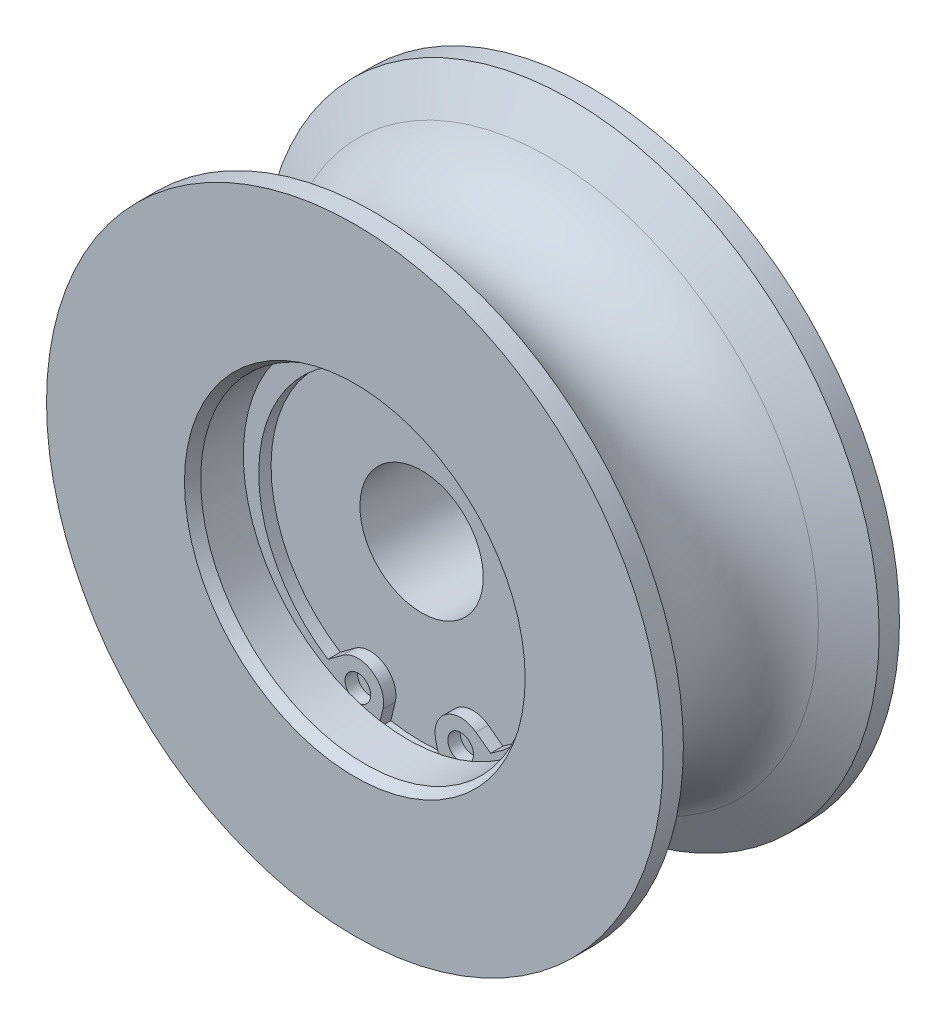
ISO-10303-21;
HEADER;
FILE_DESCRIPTION(('STEP AP214'),'2;1');
FILE_NAME('part.step','',(''),(''),'','','');
FILE_SCHEMA(('AUTOMOTIVE_DESIGN { 1 0 10303 214 1 1 1 1 }'));
ENDSEC;
DATA;
#1=APPLICATION_CONTEXT('core data for automotive mechanical design processes');
#2=APPLICATION_PROTOCOL_DEFINITION('international standard','automotive_design',2000,#1);
#3=PRODUCT_CONTEXT('',#1,'mechanical');
#4=PRODUCT('Part','Part','',(#3));
#5=PRODUCT_RELATED_PRODUCT_CATEGORY('part','',(#4));
#6=PRODUCT_DEFINITION_FORMATION('','',#4);
#7=PRODUCT_DEFINITION_CONTEXT('part definition',#1,'design');
#8=PRODUCT_DEFINITION('design','',#6,#7);
#9=PRODUCT_DEFINITION_SHAPE('','',#8);
#10=(LENGTH_UNIT() NAMED_UNIT(*) SI_UNIT(.MILLI.,.METRE.));
#11=(NAMED_UNIT(*) PLANE_ANGLE_UNIT() SI_UNIT($,.RADIAN.));
#12=(NAMED_UNIT(*) SI_UNIT($,.STERADIAN.) SOLID_ANGLE_UNIT());
#13=UNCERTAINTY_MEASURE_WITH_UNIT(LENGTH_MEASURE(1.E-05),#10,'distance_accuracy_value','');
#14=(GEOMETRIC_REPRESENTATION_CONTEXT(3) GLOBAL_UNCERTAINTY_ASSIGNED_CONTEXT((#13)) GLOBAL_UNIT_ASSIGNED_CONTEXT((#10,
#11,#12)) REPRESENTATION_CONTEXT('',''));
#15=CARTESIAN_POINT('',(0.,0.,0.));
#16=DIRECTION('',(0.,0.,1.));
#17=DIRECTION('',(1.,0.,0.));
#18=AXIS2_PLACEMENT_3D('',#15,#16,#17);
#19=CARTESIAN_POINT('',(17.0522,-17.110876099,5.));
#20=DIRECTION('',(0.,0.,-1.));
#21=DIRECTION('',(-1.,0.,0.));
#22=AXIS2_PLACEMENT_3D('',#19,#20,#21);
#23=PLANE('',#22);
#24=CARTESIAN_POINT('',(5.,-14.2233767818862,5.));
#25=DIRECTION('',(0.,0.,1.));
#26=DIRECTION('',(1.,0.,0.));
#27=AXIS2_PLACEMENT_3D('',#24,#25,#26);
#28=CIRCLE('',#27,1.25);
#29=CARTESIAN_POINT('',(6.25,-14.2233767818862,5.));
#30=VERTEX_POINT('',#29);
#31=EDGE_CURVE('E117',#30,#30,#28,.T.);
#32=ORIENTED_EDGE('',*,*,#31,.T.);
#33=EDGE_LOOP('',(#32));
#34=FACE_BOUND('',#33,.T.);
#35=ADVANCED_FACE('F14',(#34),#23,.F.);
#36=CARTESIAN_POINT('',(-5.,-14.2233767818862,5.));
#37=DIRECTION('',(0.,0.,-1.));
#38=DIRECTION('',(1.,0.,0.));
#39=AXIS2_PLACEMENT_3D('',#36,#37,#38);
#40=CIRCLE('',#39,1.25);
#41=CARTESIAN_POINT('',(-3.75,-14.2233767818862,5.));
#42=VERTEX_POINT('',#41);
#43=EDGE_CURVE('E143',#42,#42,#40,.T.);
#44=ORIENTED_EDGE('',*,*,#43,.F.);
#45=EDGE_LOOP('',(#44));
#46=FACE_BOUND('',#45,.T.);
#47=ADVANCED_FACE('F268',(#46),#23,.F.);
#48=CARTESIAN_POINT('',(0.,0.,0.));
#49=DIRECTION('',(0.,0.,1.));
#50=DIRECTION('',(1.,0.,0.));
#51=AXIS2_PLACEMENT_3D('',#48,#49,#50);
#52=TOROIDAL_SURFACE('',#51,30.4999999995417,8.4999999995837);
#53=CARTESIAN_POINT('',(0.,0.,-7.361215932));
#54=DIRECTION('',(0.,0.,-1.));
#55=DIRECTION('',(-1.,0.,0.));
#56=AXIS2_PLACEMENT_3D('',#53,#54,#55);
#57=CIRCLE('',#56,26.25);
#58=CARTESIAN_POINT('',(-26.25,0.,-7.361215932));
#59=VERTEX_POINT('',#58);
#60=EDGE_CURVE('E184',#59,#59,#57,.T.);
#61=ORIENTED_EDGE('',*,*,#60,.F.);
#62=EDGE_LOOP('',(#61));
#63=FACE_BOUND('',#62,.T.);
#64=CARTESIAN_POINT('',(0.,0.,7.361215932));
#65=DIRECTION('',(0.,0.,1.));
#66=DIRECTION('',(1.,0.,0.));
#67=AXIS2_PLACEMENT_3D('',#64,#65,#66);
#68=CIRCLE('',#67,26.25);
#69=CARTESIAN_POINT('',(26.25,0.,7.361215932));
#70=VERTEX_POINT('',#69);
#71=EDGE_CURVE('E144',#70,#70,#68,.T.);
#72=ORIENTED_EDGE('',*,*,#71,.F.);
#73=EDGE_LOOP('',(#72));
#74=FACE_BOUND('',#73,.T.);
#75=ADVANCED_FACE('F16',(#63,#74),#52,.F.);
#76=CARTESIAN_POINT('',(0.,0.,7.361215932));
#77=DIRECTION('',(0.,0.,1.));
#78=DIRECTION('',(1.,0.,0.));
#79=AXIS2_PLACEMENT_3D('',#76,#77,#78);
#80=CONICAL_SURFACE('',#79,26.25,1.04719755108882);
#81=CARTESIAN_POINT('',(0.,0.,9.52627944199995));
#82=DIRECTION('',(0.,0.,1.));
#83=DIRECTION('',(1.,0.,0.));
#84=AXIS2_PLACEMENT_3D('',#81,#82,#83);
#85=CIRCLE('',#84,30.);
#86=CARTESIAN_POINT('',(30.,0.,9.52627944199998));
#87=VERTEX_POINT('',#86);
#88=EDGE_CURVE('E182',#87,#87,#85,.F.);
#89=ORIENTED_EDGE('',*,*,#88,.T.);
#90=EDGE_LOOP('',(#89));
#91=FACE_BOUND('',#90,.T.);
#92=ORIENTED_EDGE('',*,*,#71,.T.);
#93=EDGE_LOOP('',(#92));
#94=FACE_BOUND('',#93,.T.);
#95=ADVANCED_FACE('F279',(#91,#94),#80,.T.);
#96=CARTESIAN_POINT('',(0.,0.,-7.361215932));
#97=DIRECTION('',(0.,0.,-1.));
#98=DIRECTION('',(-1.,0.,0.));
#99=AXIS2_PLACEMENT_3D('',#96,#97,#98);
#100=CONICAL_SURFACE('',#99,26.25,1.04719755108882);
#101=CARTESIAN_POINT('',(0.,0.,-9.52627944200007));
#102=DIRECTION('',(0.,0.,-1.));
#103=DIRECTION('',(-1.,0.,0.));
#104=AXIS2_PLACEMENT_3D('',#101,#102,#103);
#105=CIRCLE('',#104,30.);
#106=CARTESIAN_POINT('',(-30.,0.,-9.52627944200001));
#107=VERTEX_POINT('',#106);
#108=EDGE_CURVE('E179',#107,#107,#105,.F.);
#109=ORIENTED_EDGE('',*,*,#108,.T.);
#110=EDGE_LOOP('',(#109));
#111=FACE_BOUND('',#110,.T.);
#112=ORIENTED_EDGE('',*,*,#60,.T.);
#113=EDGE_LOOP('',(#112));
#114=FACE_BOUND('',#113,.T.);
#115=ADVANCED_FACE('F310',(#111,#114),#100,.T.);
#116=CARTESIAN_POINT('',(0.,0.,9.526279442));
#117=DIRECTION('',(0.,0.,1.));
#118=DIRECTION('',(1.,0.,0.));
#119=AXIS2_PLACEMENT_3D('',#116,#117,#118);
#120=CYLINDRICAL_SURFACE('',#119,30.);
#121=CARTESIAN_POINT('',(0.,0.,11.5));
#122=DIRECTION('',(0.,0.,1.));
#123=DIRECTION('',(1.,0.,0.));
#124=AXIS2_PLACEMENT_3D('',#121,#122,#123);
#125=CIRCLE('',#124,30.);
#126=CARTESIAN_POINT('',(30.,0.,11.5));
#127=VERTEX_POINT('',#126);
#128=EDGE_CURVE('E183',#127,#127,#125,.F.);
#129=ORIENTED_EDGE('',*,*,#128,.T.);
#130=EDGE_LOOP('',(#129));
#131=FACE_BOUND('',#130,.T.);
#132=ORIENTED_EDGE('',*,*,#88,.F.);
#133=EDGE_LOOP('',(#132));
#134=FACE_BOUND('',#133,.T.);
#135=ADVANCED_FACE('F301',(#131,#134),#120,.T.);
#136=CARTESIAN_POINT('',(0.,0.,-11.5));
#137=DIRECTION('',(0.,0.,1.));
#138=DIRECTION('',(1.,0.,0.));
#139=AXIS2_PLACEMENT_3D('',#136,#137,#138);
#140=CYLINDRICAL_SURFACE('',#139,30.);
#141=ORIENTED_EDGE('',*,*,#108,.F.);
#142=EDGE_LOOP('',(#141));
#143=FACE_BOUND('',#142,.T.);
#144=CARTESIAN_POINT('',(0.,0.,-11.5));
#145=DIRECTION('',(0.,0.,1.));
#146=DIRECTION('',(1.,0.,0.));
#147=AXIS2_PLACEMENT_3D('',#144,#145,#146);
#148=CIRCLE('',#147,30.);
#149=CARTESIAN_POINT('',(30.,0.,-11.5));
#150=VERTEX_POINT('',#149);
#151=EDGE_CURVE('E198',#150,#150,#148,.T.);
#152=ORIENTED_EDGE('',*,*,#151,.T.);
#153=EDGE_LOOP('',(#152));
#154=FACE_BOUND('',#153,.T.);
#155=ADVANCED_FACE('F296',(#143,#154),#140,.T.);
#156=CARTESIAN_POINT('',(30.36,-30.464467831,11.5));
#157=DIRECTION('',(0.,0.,-1.));
#158=DIRECTION('',(-1.,0.,0.));
#159=AXIS2_PLACEMENT_3D('',#156,#157,#158);
#160=PLANE('',#159);
#161=CARTESIAN_POINT('',(0.,0.,11.5));
#162=DIRECTION('',(0.,0.,1.));
#163=DIRECTION('',(1.,0.,0.));
#164=AXIS2_PLACEMENT_3D('',#161,#162,#163);
#165=CIRCLE('',#164,16.577350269);
#166=CARTESIAN_POINT('',(16.577350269,0.,11.5));
#167=VERTEX_POINT('',#166);
#168=EDGE_CURVE('E201',#167,#167,#165,.T.);
#169=ORIENTED_EDGE('',*,*,#168,.F.);
#170=EDGE_LOOP('',(#169));
#171=FACE_BOUND('',#170,.T.);
#172=ORIENTED_EDGE('',*,*,#128,.F.);
#173=EDGE_LOOP('',(#172));
#174=FACE_BOUND('',#173,.T.);
#175=ADVANCED_FACE('F293',(#171,#174),#160,.F.);
#176=CARTESIAN_POINT('',(-30.36,-30.464467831,-11.5));
#177=DIRECTION('',(0.,0.,1.));
#178=DIRECTION('',(1.,0.,0.));
#179=AXIS2_PLACEMENT_3D('',#176,#177,#178);
#180=PLANE('',#179);
#181=CARTESIAN_POINT('',(0.,0.,-11.5));
#182=DIRECTION('',(0.,0.,1.));
#183=DIRECTION('',(1.,0.,0.));
#184=AXIS2_PLACEMENT_3D('',#181,#182,#183);
#185=CIRCLE('',#184,13.);
#186=CARTESIAN_POINT('',(13.,0.,-11.5));
#187=VERTEX_POINT('',#186);
#188=EDGE_CURVE('E194',#187,#187,#185,.F.);
#189=ORIENTED_EDGE('',*,*,#188,.F.);
#190=EDGE_LOOP('',(#189));
#191=FACE_BOUND('',#190,.T.);
#192=ORIENTED_EDGE('',*,*,#151,.F.);
#193=EDGE_LOOP('',(#192));
#194=FACE_BOUND('',#193,.T.);
#195=ADVANCED_FACE('F290',(#191,#194),#180,.F.);
#196=CARTESIAN_POINT('',(0.,0.,10.5));
#197=DIRECTION('',(0.,0.,1.));
#198=DIRECTION('',(1.,0.,0.));
#199=AXIS2_PLACEMENT_3D('',#196,#197,#198);
#200=CONICAL_SURFACE('',#199,16.,0.523598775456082);
#201=CARTESIAN_POINT('',(0.,0.,10.5));
#202=DIRECTION('',(0.,0.,1.));
#203=DIRECTION('',(1.,0.,0.));
#204=AXIS2_PLACEMENT_3D('',#201,#202,#203);
#205=CIRCLE('',#204,16.);
#206=CARTESIAN_POINT('',(16.,0.,10.5));
#207=VERTEX_POINT('',#206);
#208=EDGE_CURVE('E191',#207,#207,#205,.T.);
#209=ORIENTED_EDGE('',*,*,#208,.F.);
#210=EDGE_LOOP('',(#209));
#211=FACE_BOUND('',#210,.T.);
#212=ORIENTED_EDGE('',*,*,#168,.T.);
#213=EDGE_LOOP('',(#212));
#214=FACE_BOUND('',#213,.T.);
#215=ADVANCED_FACE('F292',(#211,#214),#200,.F.);
#216=CARTESIAN_POINT('',(0.,0.,-11.5));
#217=DIRECTION('',(0.,0.,1.));
#218=DIRECTION('',(1.,0.,0.));
#219=AXIS2_PLACEMENT_3D('',#216,#217,#218);
#220=CYLINDRICAL_SURFACE('',#219,13.);
#221=ORIENTED_EDGE('',*,*,#188,.T.);
#222=EDGE_LOOP('',(#221));
#223=FACE_BOUND('',#222,.T.);
#224=CARTESIAN_POINT('',(0.,0.,-5.));
#225=DIRECTION('',(0.,0.,1.));
#226=DIRECTION('',(1.,0.,0.));
#227=AXIS2_PLACEMENT_3D('',#224,#225,#226);
#228=CIRCLE('',#227,13.);
#229=CARTESIAN_POINT('',(13.,0.,-5.));
#230=VERTEX_POINT('',#229);
#231=EDGE_CURVE('E195',#230,#230,#228,.F.);
#232=ORIENTED_EDGE('',*,*,#231,.F.);
#233=EDGE_LOOP('',(#232));
#234=FACE_BOUND('',#233,.T.);
#235=ADVANCED_FACE('F331',(#223,#234),#220,.F.);
#236=CARTESIAN_POINT('',(0.,0.,6.35));
#237=DIRECTION('',(0.,0.,1.));
#238=DIRECTION('',(1.,0.,0.));
#239=AXIS2_PLACEMENT_3D('',#236,#237,#238);
#240=CYLINDRICAL_SURFACE('',#239,16.);
#241=CARTESIAN_POINT('',(0.,0.,6.35));
#242=DIRECTION('',(0.,0.,1.));
#243=DIRECTION('',(1.,0.,0.));
#244=AXIS2_PLACEMENT_3D('',#241,#242,#243);
#245=CIRCLE('',#244,16.);
#246=CARTESIAN_POINT('',(16.,0.,6.35));
#247=VERTEX_POINT('',#246);
#248=EDGE_CURVE('E208',#247,#247,#245,.T.);
#249=ORIENTED_EDGE('',*,*,#248,.F.);
#250=EDGE_LOOP('',(#249));
#251=FACE_BOUND('',#250,.T.);
#252=ORIENTED_EDGE('',*,*,#208,.T.);
#253=EDGE_LOOP('',(#252));
#254=FACE_BOUND('',#253,.T.);
#255=ADVANCED_FACE('F288',(#251,#254),#240,.F.);
#256=CARTESIAN_POINT('',(-13.156,-13.201269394,-5.));
#257=DIRECTION('',(0.,0.,1.));
#258=DIRECTION('',(1.,0.,0.));
#259=AXIS2_PLACEMENT_3D('',#256,#257,#258);
#260=PLANE('',#259);
#261=CARTESIAN_POINT('',(0.,0.,-5.));
#262=DIRECTION('',(0.,0.,1.));
#263=DIRECTION('',(0.,-1.,0.));
#264=AXIS2_PLACEMENT_3D('',#261,#262,#263);
#265=CIRCLE('',#264,6.);
#266=CARTESIAN_POINT('',(0.,-6.,-5.));
#267=VERTEX_POINT('',#266);
#268=EDGE_CURVE('E211',#267,#267,#265,.F.);
#269=ORIENTED_EDGE('',*,*,#268,.F.);
#270=EDGE_LOOP('',(#269));
#271=FACE_BOUND('',#270,.T.);
#272=ORIENTED_EDGE('',*,*,#231,.T.);
#273=EDGE_LOOP('',(#272));
#274=FACE_BOUND('',#273,.T.);
#275=ADVANCED_FACE('F284',(#271,#274),#260,.F.);
#276=CARTESIAN_POINT('',(-17.0522,-17.110876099,6.35));
#277=DIRECTION('',(0.,0.,1.));
#278=DIRECTION('',(1.,0.,0.));
#279=AXIS2_PLACEMENT_3D('',#276,#277,#278);
#280=PLANE('',#279);
#281=ORIENTED_EDGE('',*,*,#248,.T.);
#282=EDGE_LOOP('',(#281));
#283=FACE_BOUND('',#282,.T.);
#284=CARTESIAN_POINT('',(0.,0.,6.35));
#285=DIRECTION('',(0.,0.,1.));
#286=DIRECTION('',(1.,0.,0.));
#287=AXIS2_PLACEMENT_3D('',#284,#285,#286);
#288=CIRCLE('',#287,16.85);
#289=CARTESIAN_POINT('',(16.85,0.,6.35));
#290=VERTEX_POINT('',#289);
#291=EDGE_CURVE('E214',#290,#290,#288,.T.);
#292=ORIENTED_EDGE('',*,*,#291,.F.);
#293=EDGE_LOOP('',(#292));
#294=FACE_BOUND('',#293,.T.);
#295=ADVANCED_FACE('F281',(#283,#294),#280,.F.);
#296=CARTESIAN_POINT('',(0.,0.,5.));
#297=DIRECTION('',(0.,0.,1.));
#298=DIRECTION('',(1.,0.,0.));
#299=AXIS2_PLACEMENT_3D('',#296,#297,#298);
#300=CYLINDRICAL_SURFACE('',#299,16.85);
#301=ORIENTED_EDGE('',*,*,#291,.T.);
#302=EDGE_LOOP('',(#301));
#303=FACE_BOUND('',#302,.T.);
#304=DIRECTION('',(0.,0.,1.));
#305=VECTOR('',#304,1.);
#306=CARTESIAN_POINT('',(2.99125499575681,-16.5823669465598,5.));
#307=LINE('',#306,#305);
#308=CARTESIAN_POINT('',(2.99125499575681,-16.5823669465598,5.));
#309=VERTEX_POINT('',#308);
#310=CARTESIAN_POINT('',(2.99125499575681,-16.5823669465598,6.2));
#311=VERTEX_POINT('',#310);
#312=EDGE_CURVE('E18',#309,#311,#307,.T.);
#313=ORIENTED_EDGE('',*,*,#312,.F.);
#314=CARTESIAN_POINT('',(0.,0.,5.));
#315=DIRECTION('',(0.,0.,1.));
#316=DIRECTION('',(1.,0.,0.));
#317=AXIS2_PLACEMENT_3D('',#314,#315,#316);
#318=CIRCLE('',#317,16.85);
#319=CARTESIAN_POINT('',(-2.99125499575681,-16.5823669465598,5.));
#320=VERTEX_POINT('',#319);
#321=EDGE_CURVE('E220',#320,#309,#318,.T.);
#322=ORIENTED_EDGE('',*,*,#321,.F.);
#323=DIRECTION('',(0.,0.,1.));
#324=VECTOR('',#323,1.);
#325=CARTESIAN_POINT('',(-2.99125499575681,-16.5823669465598,5.));
#326=LINE('',#325,#324);
#327=CARTESIAN_POINT('',(-2.99125499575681,-16.5823669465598,6.2));
#328=VERTEX_POINT('',#327);
#329=EDGE_CURVE('E176',#328,#320,#326,.F.);
#330=ORIENTED_EDGE('',*,*,#329,.F.);
#331=CARTESIAN_POINT('',(0.,0.,6.2));
#332=DIRECTION('',(0.,0.,-1.));
#333=DIRECTION('',(-1.,0.,0.));
#334=AXIS2_PLACEMENT_3D('',#331,#332,#333);
#335=CIRCLE('',#334,16.85);
#336=EDGE_CURVE('E9',#311,#328,#335,.F.);
#337=ORIENTED_EDGE('',*,*,#336,.F.);
#338=EDGE_LOOP('',(#313,#322,#330,#337));
#339=FACE_BOUND('',#338,.T.);
#340=ADVANCED_FACE('F226',(#303,#339),#300,.F.);
#341=CARTESIAN_POINT('',(0.,0.,-5.));
#342=DIRECTION('',(0.,0.,1.));
#343=DIRECTION('',(0.,-1.,0.));
#344=AXIS2_PLACEMENT_3D('',#341,#342,#343);
#345=CYLINDRICAL_SURFACE('',#344,6.);
#346=ORIENTED_EDGE('',*,*,#268,.T.);
#347=EDGE_LOOP('',(#346));
#348=FACE_BOUND('',#347,.T.);
#349=CARTESIAN_POINT('',(0.,0.,5.));
#350=DIRECTION('',(0.,0.,1.));
#351=DIRECTION('',(0.,-1.,0.));
#352=AXIS2_PLACEMENT_3D('',#349,#350,#351);
#353=CIRCLE('',#352,6.);
#354=CARTESIAN_POINT('',(0.,-6.,5.));
#355=VERTEX_POINT('',#354);
#356=EDGE_CURVE('E217',#355,#355,#353,.F.);
#357=ORIENTED_EDGE('',*,*,#356,.F.);
#358=EDGE_LOOP('',(#357));
#359=FACE_BOUND('',#358,.T.);
#360=ADVANCED_FACE('F265',(#348,#359),#345,.F.);
#361=ORIENTED_EDGE('',*,*,#356,.T.);
#362=EDGE_LOOP('',(#361));
#363=FACE_BOUND('',#362,.T.);
#364=ORIENTED_EDGE('',*,*,#321,.T.);
#365=DIRECTION('',(0.231349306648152,-0.972870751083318,0.));
#366=VECTOR('',#365,1.);
#367=CARTESIAN_POINT('',(2.5678231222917,-14.8017500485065,5.));
#368=LINE('',#367,#366);
#369=CARTESIAN_POINT('',(2.5678231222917,-14.8017500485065,5.));
#370=VERTEX_POINT('',#369);
#371=EDGE_CURVE('E34',#370,#309,#368,.T.);
#372=ORIENTED_EDGE('',*,*,#371,.F.);
#373=CARTESIAN_POINT('',(5.,-14.2233767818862,5.));
#374=DIRECTION('',(0.,0.,1.));
#375=DIRECTION('',(1.,0.,0.));
#376=AXIS2_PLACEMENT_3D('',#373,#374,#375);
#377=CIRCLE('',#376,2.5);
#378=CARTESIAN_POINT('',(6.49138441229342,-12.2169439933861,5.));
#379=VERTEX_POINT('',#378);
#380=EDGE_CURVE('E134',#379,#370,#377,.T.);
#381=ORIENTED_EDGE('',*,*,#380,.F.);
#382=DIRECTION('',(-0.802573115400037,0.596553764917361,0.));
#383=VECTOR('',#382,1.);
#384=CARTESIAN_POINT('',(6.49138441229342,-12.2169439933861,5.));
#385=LINE('',#384,#383);
#386=CARTESIAN_POINT('',(7.91695293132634,-13.2765711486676,5.));
#387=VERTEX_POINT('',#386);
#388=EDGE_CURVE('E148',#387,#379,#385,.T.);
#389=ORIENTED_EDGE('',*,*,#388,.F.);
#390=CARTESIAN_POINT('',(0.,-0.95,5.));
#391=DIRECTION('',(0.,0.,-1.));
#392=DIRECTION('',(0.,-1.,0.));
#393=AXIS2_PLACEMENT_3D('',#390,#391,#392);
#394=CIRCLE('',#393,14.65);
#395=CARTESIAN_POINT('',(-7.91695293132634,-13.2765711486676,5.));
#396=VERTEX_POINT('',#395);
#397=EDGE_CURVE('E163',#396,#387,#394,.T.);
#398=ORIENTED_EDGE('',*,*,#397,.F.);
#399=DIRECTION('',(-0.802573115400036,-0.596553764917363,0.));
#400=VECTOR('',#399,1.);
#401=CARTESIAN_POINT('',(-6.49138441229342,-12.2169439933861,5.));
#402=LINE('',#401,#400);
#403=CARTESIAN_POINT('',(-6.49138441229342,-12.2169439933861,5.));
#404=VERTEX_POINT('',#403);
#405=EDGE_CURVE('E116',#404,#396,#402,.T.);
#406=ORIENTED_EDGE('',*,*,#405,.F.);
#407=CARTESIAN_POINT('',(-5.,-14.2233767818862,5.));
#408=DIRECTION('',(0.,0.,1.));
#409=DIRECTION('',(-1.,0.,0.));
#410=AXIS2_PLACEMENT_3D('',#407,#408,#409);
#411=CIRCLE('',#410,2.5);
#412=CARTESIAN_POINT('',(-2.56782312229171,-14.8017500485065,5.));
#413=VERTEX_POINT('',#412);
#414=EDGE_CURVE('E113',#413,#404,#411,.T.);
#415=ORIENTED_EDGE('',*,*,#414,.F.);
#416=DIRECTION('',(0.231349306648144,0.97287075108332,0.));
#417=VECTOR('',#416,1.);
#418=CARTESIAN_POINT('',(-2.56782312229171,-14.8017500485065,5.));
#419=LINE('',#418,#417);
#420=EDGE_CURVE('E155',#320,#413,#419,.T.);
#421=ORIENTED_EDGE('',*,*,#420,.F.);
#422=EDGE_LOOP('',(#364,#372,#381,#389,#398,#406,#415,#421));
#423=FACE_BOUND('',#422,.T.);
#424=ADVANCED_FACE('F224',(#363,#423),#23,.F.);
#425=CARTESIAN_POINT('',(0.,-0.95,6.2));
#426=DIRECTION('',(0.,0.,1.));
#427=DIRECTION('',(-1.,0.,0.));
#428=AXIS2_PLACEMENT_3D('',#425,#426,#427);
#429=CYLINDRICAL_SURFACE('',#428,14.65);
#430=ORIENTED_EDGE('',*,*,#397,.T.);
#431=DIRECTION('',(0.,0.,-1.));
#432=VECTOR('',#431,1.);
#433=CARTESIAN_POINT('',(7.91695293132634,-13.2765711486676,6.2));
#434=LINE('',#433,#432);
#435=CARTESIAN_POINT('',(7.91695293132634,-13.2765711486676,6.2));
#436=VERTEX_POINT('',#435);
#437=EDGE_CURVE('E103',#436,#387,#434,.T.);
#438=ORIENTED_EDGE('',*,*,#437,.F.);
#439=CARTESIAN_POINT('',(0.,-0.95,6.2));
#440=DIRECTION('',(0.,0.,-1.));
#441=DIRECTION('',(0.,-1.,0.));
#442=AXIS2_PLACEMENT_3D('',#439,#440,#441);
#443=CIRCLE('',#442,14.65);
#444=CARTESIAN_POINT('',(-7.91695293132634,-13.2765711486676,6.2));
#445=VERTEX_POINT('',#444);
#446=EDGE_CURVE('E104',#445,#436,#443,.T.);
#447=ORIENTED_EDGE('',*,*,#446,.F.);
#448=DIRECTION('',(0.,0.,-1.));
#449=VECTOR('',#448,1.);
#450=CARTESIAN_POINT('',(-7.91695293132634,-13.2765711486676,6.2));
#451=LINE('',#450,#449);
#452=EDGE_CURVE('E98',#445,#396,#451,.T.);
#453=ORIENTED_EDGE('',*,*,#452,.T.);
#454=EDGE_LOOP('',(#430,#438,#447,#453));
#455=FACE_BOUND('',#454,.T.);
#456=ADVANCED_FACE('F256',(#455),#429,.F.);
#457=CARTESIAN_POINT('',(6.49138441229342,-12.2169439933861,6.2));
#458=DIRECTION('',(-0.596553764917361,-0.802573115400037,0.));
#459=DIRECTION('',(-0.802573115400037,0.596553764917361,0.));
#460=AXIS2_PLACEMENT_3D('',#457,#458,#459);
#461=PLANE('',#460);
#462=ORIENTED_EDGE('',*,*,#388,.T.);
#463=DIRECTION('',(0.,0.,-1.));
#464=VECTOR('',#463,1.);
#465=CARTESIAN_POINT('',(6.49138441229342,-12.2169439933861,6.2));
#466=LINE('',#465,#464);
#467=CARTESIAN_POINT('',(6.49138441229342,-12.2169439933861,6.2));
#468=VERTEX_POINT('',#467);
#469=EDGE_CURVE('E153',#468,#379,#466,.T.);
#470=ORIENTED_EDGE('',*,*,#469,.F.);
#471=DIRECTION('',(-0.802573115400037,0.596553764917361,0.));
#472=VECTOR('',#471,1.);
#473=CARTESIAN_POINT('',(6.49138441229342,-12.2169439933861,6.2));
#474=LINE('',#473,#472);
#475=EDGE_CURVE('E138',#436,#468,#474,.T.);
#476=ORIENTED_EDGE('',*,*,#475,.F.);
#477=ORIENTED_EDGE('',*,*,#437,.T.);
#478=EDGE_LOOP('',(#462,#470,#476,#477));
#479=FACE_BOUND('',#478,.T.);
#480=ADVANCED_FACE('F251',(#479),#461,.F.);
#481=CARTESIAN_POINT('',(5.,-14.2233767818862,6.2));
#482=DIRECTION('',(0.,0.,1.));
#483=DIRECTION('',(-1.,0.,0.));
#484=AXIS2_PLACEMENT_3D('',#481,#482,#483);
#485=CYLINDRICAL_SURFACE('',#484,2.5);
#486=ORIENTED_EDGE('',*,*,#380,.T.);
#487=DIRECTION('',(0.,0.,-1.));
#488=VECTOR('',#487,1.);
#489=CARTESIAN_POINT('',(2.5678231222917,-14.8017500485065,6.2));
#490=LINE('',#489,#488);
#491=CARTESIAN_POINT('',(2.5678231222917,-14.8017500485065,6.2));
#492=VERTEX_POINT('',#491);
#493=EDGE_CURVE('E154',#492,#370,#490,.T.);
#494=ORIENTED_EDGE('',*,*,#493,.F.);
#495=CARTESIAN_POINT('',(5.,-14.2233767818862,6.2));
#496=DIRECTION('',(0.,0.,1.));
#497=DIRECTION('',(1.,0.,0.));
#498=AXIS2_PLACEMENT_3D('',#495,#496,#497);
#499=CIRCLE('',#498,2.5);
#500=EDGE_CURVE('E167',#468,#492,#499,.T.);
#501=ORIENTED_EDGE('',*,*,#500,.F.);
#502=ORIENTED_EDGE('',*,*,#469,.T.);
#503=EDGE_LOOP('',(#486,#494,#501,#502));
#504=FACE_BOUND('',#503,.T.);
#505=ADVANCED_FACE('F234',(#504),#485,.T.);
#506=CARTESIAN_POINT('',(-2.56782312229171,-14.8017500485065,6.2));
#507=DIRECTION('',(-0.97287075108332,0.231349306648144,0.));
#508=DIRECTION('',(0.,0.,1.));
#509=AXIS2_PLACEMENT_3D('',#506,#507,#508);
#510=PLANE('',#509);
#511=DIRECTION('',(0.231349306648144,0.97287075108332,0.));
#512=VECTOR('',#511,1.);
#513=CARTESIAN_POINT('',(-2.56782312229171,-14.8017500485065,6.2));
#514=LINE('',#513,#512);
#515=CARTESIAN_POINT('',(-2.56782312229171,-14.8017500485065,6.2));
#516=VERTEX_POINT('',#515);
#517=EDGE_CURVE('E122',#328,#516,#514,.T.);
#518=ORIENTED_EDGE('',*,*,#517,.F.);
#519=ORIENTED_EDGE('',*,*,#329,.T.);
#520=ORIENTED_EDGE('',*,*,#420,.T.);
#521=DIRECTION('',(0.,0.,-1.));
#522=VECTOR('',#521,1.);
#523=CARTESIAN_POINT('',(-2.56782312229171,-14.8017500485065,6.2));
#524=LINE('',#523,#522);
#525=EDGE_CURVE('E172',#516,#413,#524,.T.);
#526=ORIENTED_EDGE('',*,*,#525,.F.);
#527=EDGE_LOOP('',(#518,#519,#520,#526));
#528=FACE_BOUND('',#527,.T.);
#529=ADVANCED_FACE('F345',(#528),#510,.F.);
#530=CARTESIAN_POINT('',(0.,-0.95,6.2));
#531=DIRECTION('',(0.,0.,-1.));
#532=DIRECTION('',(0.,-1.,0.));
#533=AXIS2_PLACEMENT_3D('',#530,#531,#532);
#534=PLANE('',#533);
#535=CARTESIAN_POINT('',(-5.,-14.2233767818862,6.2));
#536=DIRECTION('',(0.,0.,-1.));
#537=DIRECTION('',(1.,0.,0.));
#538=AXIS2_PLACEMENT_3D('',#535,#536,#537);
#539=CIRCLE('',#538,1.25);
#540=CARTESIAN_POINT('',(-3.75,-14.2233767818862,6.2));
#541=VERTEX_POINT('',#540);
#542=EDGE_CURVE('E124',#541,#541,#539,.T.);
#543=ORIENTED_EDGE('',*,*,#542,.T.);
#544=EDGE_LOOP('',(#543));
#545=FACE_BOUND('',#544,.T.);
#546=CARTESIAN_POINT('',(5.,-14.2233767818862,6.2));
#547=DIRECTION('',(0.,0.,1.));
#548=DIRECTION('',(1.,0.,0.));
#549=AXIS2_PLACEMENT_3D('',#546,#547,#548);
#550=CIRCLE('',#549,1.25);
#551=CARTESIAN_POINT('',(6.25,-14.2233767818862,6.2));
#552=VERTEX_POINT('',#551);
#553=EDGE_CURVE('E140',#552,#552,#550,.T.);
#554=ORIENTED_EDGE('',*,*,#553,.F.);
#555=EDGE_LOOP('',(#554));
#556=FACE_BOUND('',#555,.T.);
#557=DIRECTION('',(0.231349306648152,-0.972870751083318,0.));
#558=VECTOR('',#557,1.);
#559=CARTESIAN_POINT('',(2.5678231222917,-14.8017500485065,6.2));
#560=LINE('',#559,#558);
#561=EDGE_CURVE('E130',#492,#311,#560,.T.);
#562=ORIENTED_EDGE('',*,*,#561,.T.);
#563=ORIENTED_EDGE('',*,*,#336,.T.);
#564=ORIENTED_EDGE('',*,*,#517,.T.);
#565=CARTESIAN_POINT('',(-5.,-14.2233767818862,6.2));
#566=DIRECTION('',(0.,0.,1.));
#567=DIRECTION('',(-1.,0.,0.));
#568=AXIS2_PLACEMENT_3D('',#565,#566,#567);
#569=CIRCLE('',#568,2.5);
#570=CARTESIAN_POINT('',(-6.49138441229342,-12.2169439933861,6.2));
#571=VERTEX_POINT('',#570);
#572=EDGE_CURVE('E110',#516,#571,#569,.T.);
#573=ORIENTED_EDGE('',*,*,#572,.T.);
#574=DIRECTION('',(-0.802573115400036,-0.596553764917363,0.));
#575=VECTOR('',#574,1.);
#576=CARTESIAN_POINT('',(-6.49138441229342,-12.2169439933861,6.2));
#577=LINE('',#576,#575);
#578=EDGE_CURVE('E93',#571,#445,#577,.T.);
#579=ORIENTED_EDGE('',*,*,#578,.T.);
#580=ORIENTED_EDGE('',*,*,#446,.T.);
#581=ORIENTED_EDGE('',*,*,#475,.T.);
#582=ORIENTED_EDGE('',*,*,#500,.T.);
#583=EDGE_LOOP('',(#562,#563,#564,#573,#579,#580,#581,#582));
#584=FACE_BOUND('',#583,.T.);
#585=ADVANCED_FACE('F120',(#545,#556,#584),#534,.F.);
#586=CARTESIAN_POINT('',(5.,-14.2233767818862,6.2));
#587=DIRECTION('',(0.,0.,1.));
#588=DIRECTION('',(-1.,0.,0.));
#589=AXIS2_PLACEMENT_3D('',#586,#587,#588);
#590=CYLINDRICAL_SURFACE('',#589,1.25);
#591=ORIENTED_EDGE('',*,*,#31,.F.);
#592=EDGE_LOOP('',(#591));
#593=FACE_BOUND('',#592,.T.);
#594=ORIENTED_EDGE('',*,*,#553,.T.);
#595=EDGE_LOOP('',(#594));
#596=FACE_BOUND('',#595,.T.);
#597=ADVANCED_FACE('F354',(#593,#596),#590,.F.);
#598=CARTESIAN_POINT('',(-5.,-14.2233767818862,6.2));
#599=DIRECTION('',(0.,0.,1.));
#600=DIRECTION('',(-1.,0.,0.));
#601=AXIS2_PLACEMENT_3D('',#598,#599,#600);
#602=CYLINDRICAL_SURFACE('',#601,1.25);
#603=ORIENTED_EDGE('',*,*,#43,.T.);
#604=EDGE_LOOP('',(#603));
#605=FACE_BOUND('',#604,.T.);
#606=ORIENTED_EDGE('',*,*,#542,.F.);
#607=EDGE_LOOP('',(#606));
#608=FACE_BOUND('',#607,.T.);
#609=ADVANCED_FACE('F362',(#605,#608),#602,.F.);
#610=CARTESIAN_POINT('',(-6.49138441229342,-12.2169439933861,6.2));
#611=DIRECTION('',(0.596553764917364,-0.802573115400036,0.));
#612=DIRECTION('',(0.,0.,-1.));
#613=AXIS2_PLACEMENT_3D('',#610,#611,#612);
#614=PLANE('',#613);
#615=ORIENTED_EDGE('',*,*,#405,.T.);
#616=ORIENTED_EDGE('',*,*,#452,.F.);
#617=ORIENTED_EDGE('',*,*,#578,.F.);
#618=DIRECTION('',(0.,0.,-1.));
#619=VECTOR('',#618,1.);
#620=CARTESIAN_POINT('',(-6.49138441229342,-12.2169439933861,6.2));
#621=LINE('',#620,#619);
#622=EDGE_CURVE('E96',#571,#404,#621,.T.);
#623=ORIENTED_EDGE('',*,*,#622,.T.);
#624=EDGE_LOOP('',(#615,#616,#617,#623));
#625=FACE_BOUND('',#624,.T.);
#626=ADVANCED_FACE('F95',(#625),#614,.F.);
#627=CARTESIAN_POINT('',(-5.,-14.2233767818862,6.2));
#628=DIRECTION('',(0.,0.,1.));
#629=DIRECTION('',(-1.,0.,0.));
#630=AXIS2_PLACEMENT_3D('',#627,#628,#629);
#631=CYLINDRICAL_SURFACE('',#630,2.5);
#632=ORIENTED_EDGE('',*,*,#414,.T.);
#633=ORIENTED_EDGE('',*,*,#622,.F.);
#634=ORIENTED_EDGE('',*,*,#572,.F.);
#635=ORIENTED_EDGE('',*,*,#525,.T.);
#636=EDGE_LOOP('',(#632,#633,#634,#635));
#637=FACE_BOUND('',#636,.T.);
#638=ADVANCED_FACE('F108',(#637),#631,.T.);
#639=CARTESIAN_POINT('',(2.5678231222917,-14.8017500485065,6.2));
#640=DIRECTION('',(0.972870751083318,0.231349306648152,0.));
#641=DIRECTION('',(0.,0.,-1.));
#642=AXIS2_PLACEMENT_3D('',#639,#640,#641);
#643=PLANE('',#642);
#644=ORIENTED_EDGE('',*,*,#371,.T.);
#645=ORIENTED_EDGE('',*,*,#312,.T.);
#646=ORIENTED_EDGE('',*,*,#561,.F.);
#647=ORIENTED_EDGE('',*,*,#493,.T.);
#648=EDGE_LOOP('',(#644,#645,#646,#647));
#649=FACE_BOUND('',#648,.T.);
#650=ADVANCED_FACE('F227',(#649),#643,.F.);
#651=CLOSED_SHELL('',(#35,#47,#75,#95,#115,#135,#155,#175,#195,#215,#235,#255,#275,#295,#340,
#360,#424,#456,#480,#505,#529,#585,#597,#609,#626,#638,#650));
#652=MANIFOLD_SOLID_BREP('B1',#651);
#653=ADVANCED_BREP_SHAPE_REPRESENTATION('',(#18,#652),#14);
#654=SHAPE_DEFINITION_REPRESENTATION(#9,#653);
ENDSEC;
END-ISO-10303-21;
